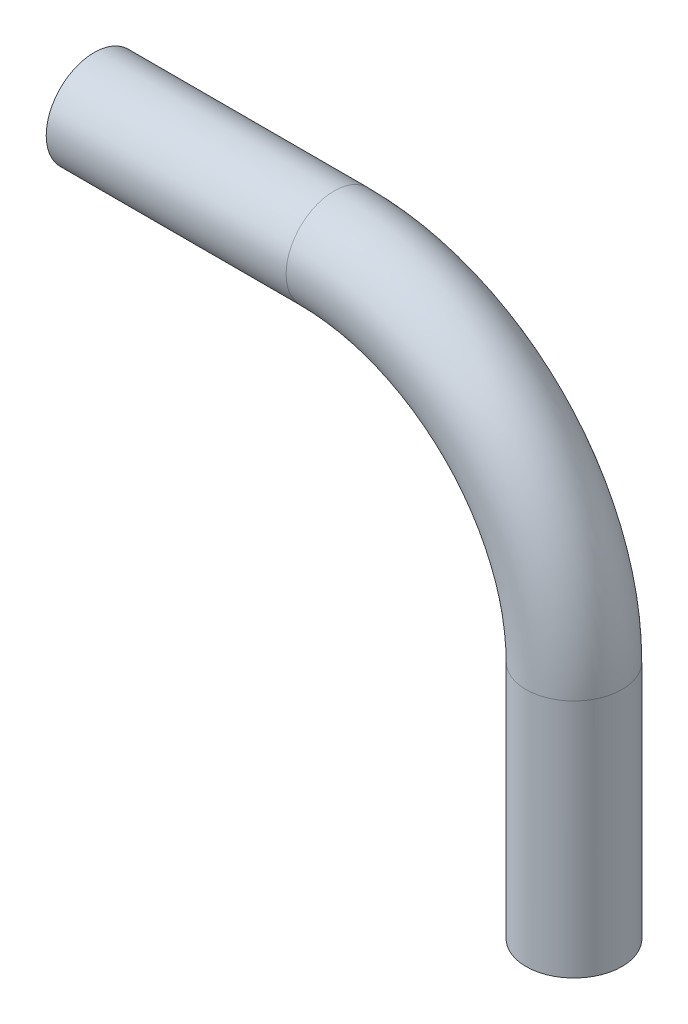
ISO-10303-21;
HEADER;
FILE_DESCRIPTION(('STEP AP214'),'2;1');
FILE_NAME('part.step','',(''),(''),'','','');
FILE_SCHEMA(('AUTOMOTIVE_DESIGN { 1 0 10303 214 1 1 1 1 }'));
ENDSEC;
DATA;
#1=APPLICATION_CONTEXT('core data for automotive mechanical design processes');
#2=APPLICATION_PROTOCOL_DEFINITION('international standard','automotive_design',2000,#1);
#3=PRODUCT_CONTEXT('',#1,'mechanical');
#4=PRODUCT('Part','Part','',(#3));
#5=PRODUCT_RELATED_PRODUCT_CATEGORY('part','',(#4));
#6=PRODUCT_DEFINITION_FORMATION('','',#4);
#7=PRODUCT_DEFINITION_CONTEXT('part definition',#1,'design');
#8=PRODUCT_DEFINITION('design','',#6,#7);
#9=PRODUCT_DEFINITION_SHAPE('','',#8);
#10=(LENGTH_UNIT() NAMED_UNIT(*) SI_UNIT(.MILLI.,.METRE.));
#11=(NAMED_UNIT(*) PLANE_ANGLE_UNIT() SI_UNIT($,.RADIAN.));
#12=(NAMED_UNIT(*) SI_UNIT($,.STERADIAN.) SOLID_ANGLE_UNIT());
#13=UNCERTAINTY_MEASURE_WITH_UNIT(LENGTH_MEASURE(1.E-05),#10,'distance_accuracy_value','');
#14=(GEOMETRIC_REPRESENTATION_CONTEXT(3) GLOBAL_UNCERTAINTY_ASSIGNED_CONTEXT((#13)) GLOBAL_UNIT_ASSIGNED_CONTEXT((#10,
#11,#12)) REPRESENTATION_CONTEXT('',''));
#15=CARTESIAN_POINT('',(0.,0.,0.));
#16=DIRECTION('',(0.,0.,1.));
#17=DIRECTION('',(1.,0.,0.));
#18=AXIS2_PLACEMENT_3D('',#15,#16,#17);
#19=CARTESIAN_POINT('',(-23.8125,47.625,0.));
#20=DIRECTION('',(-1.,0.,0.));
#21=DIRECTION('',(0.,0.,1.));
#22=AXIS2_PLACEMENT_3D('',#19,#20,#21);
#23=CYLINDRICAL_SURFACE('',#22,4.7625);
#24=CARTESIAN_POINT('',(-23.8125,47.625,0.));
#25=DIRECTION('',(-1.,0.,0.));
#26=DIRECTION('',(0.,0.,1.));
#27=AXIS2_PLACEMENT_3D('',#24,#25,#26);
#28=CIRCLE('',#27,4.7625);
#29=CARTESIAN_POINT('',(-23.8125,52.3875,0.));
#30=VERTEX_POINT('',#29);
#31=EDGE_CURVE('E49',#30,#30,#28,.T.);
#32=ORIENTED_EDGE('',*,*,#31,.T.);
#33=EDGE_LOOP('',(#32));
#34=FACE_BOUND('',#33,.T.);
#35=CARTESIAN_POINT('',(-47.625,47.625,0.));
#36=DIRECTION('',(-1.,0.,0.));
#37=DIRECTION('',(0.,0.,1.));
#38=AXIS2_PLACEMENT_3D('',#35,#36,#37);
#39=CIRCLE('',#38,4.7625);
#40=CARTESIAN_POINT('',(-47.625,47.625,4.7625));
#41=VERTEX_POINT('',#40);
#42=EDGE_CURVE('E10',#41,#41,#39,.T.);
#43=ORIENTED_EDGE('',*,*,#42,.F.);
#44=EDGE_LOOP('',(#43));
#45=FACE_BOUND('',#44,.T.);
#46=ADVANCED_FACE('F36',(#34,#45),#23,.T.);
#47=CARTESIAN_POINT('',(-23.8125,47.625,0.));
#48=DIRECTION('',(-1.,0.,0.));
#49=DIRECTION('',(0.,0.,1.));
#50=AXIS2_PLACEMENT_3D('',#47,#48,#49);
#51=CYLINDRICAL_SURFACE('',#50,3.8735);
#52=CARTESIAN_POINT('',(-23.8125,47.625,0.));
#53=DIRECTION('',(-1.,0.,0.));
#54=DIRECTION('',(0.,0.,1.));
#55=AXIS2_PLACEMENT_3D('',#52,#53,#54);
#56=CIRCLE('',#55,3.8735);
#57=CARTESIAN_POINT('',(-23.8125,51.4985,0.));
#58=VERTEX_POINT('',#57);
#59=EDGE_CURVE('E54',#58,#58,#56,.T.);
#60=ORIENTED_EDGE('',*,*,#59,.F.);
#61=EDGE_LOOP('',(#60));
#62=FACE_BOUND('',#61,.T.);
#63=CARTESIAN_POINT('',(-47.625,47.625,0.));
#64=DIRECTION('',(-1.,0.,0.));
#65=DIRECTION('',(0.,0.,1.));
#66=AXIS2_PLACEMENT_3D('',#63,#64,#65);
#67=CIRCLE('',#66,3.8735);
#68=CARTESIAN_POINT('',(-47.625,47.625,3.8735));
#69=VERTEX_POINT('',#68);
#70=EDGE_CURVE('E43',#69,#69,#67,.T.);
#71=ORIENTED_EDGE('',*,*,#70,.T.);
#72=EDGE_LOOP('',(#71));
#73=FACE_BOUND('',#72,.T.);
#74=ADVANCED_FACE('F86',(#62,#73),#51,.F.);
#75=CARTESIAN_POINT('',(-23.8125,23.8125,0.));
#76=DIRECTION('',(0.,0.,1.));
#77=DIRECTION('',(1.,0.,0.));
#78=AXIS2_PLACEMENT_3D('',#75,#76,#77);
#79=TOROIDAL_SURFACE('',#78,23.8125,4.7625);
#80=CARTESIAN_POINT('',(0.,23.8125,0.));
#81=DIRECTION('',(0.,1.,0.));
#82=DIRECTION('',(0.,0.,1.));
#83=AXIS2_PLACEMENT_3D('',#80,#81,#82);
#84=CIRCLE('',#83,4.7625);
#85=CARTESIAN_POINT('',(4.7625,23.8125,0.));
#86=VERTEX_POINT('',#85);
#87=EDGE_CURVE('E60',#86,#86,#84,.T.);
#88=CARTESIAN_POINT('',(-23.8125,23.8125,0.));
#89=DIRECTION('',(0.,0.,1.));
#90=DIRECTION('',(1.,0.,0.));
#91=AXIS2_PLACEMENT_3D('',#88,#89,#90);
#92=CIRCLE('',#91,28.575);
#93=EDGE_CURVE('',#86,#30,#92,.T.);
#94=ORIENTED_EDGE('',*,*,#87,.T.);
#95=ORIENTED_EDGE('',*,*,#31,.F.);
#96=ORIENTED_EDGE('',*,*,#93,.T.);
#97=ORIENTED_EDGE('',*,*,#93,.F.);
#98=EDGE_LOOP('',(#94,#96,#95,#97));
#99=FACE_BOUND('',#98,.T.);
#100=ADVANCED_FACE('F82',(#99),#79,.T.);
#101=CARTESIAN_POINT('',(-23.8125,23.8125,0.));
#102=DIRECTION('',(0.,0.,1.));
#103=DIRECTION('',(1.,0.,0.));
#104=AXIS2_PLACEMENT_3D('',#101,#102,#103);
#105=TOROIDAL_SURFACE('',#104,23.8125,3.8735);
#106=CARTESIAN_POINT('',(0.,23.8125,0.));
#107=DIRECTION('',(0.,1.,0.));
#108=DIRECTION('',(0.,0.,1.));
#109=AXIS2_PLACEMENT_3D('',#106,#107,#108);
#110=CIRCLE('',#109,3.8735);
#111=CARTESIAN_POINT('',(3.8735,23.8125,0.));
#112=VERTEX_POINT('',#111);
#113=EDGE_CURVE('E65',#112,#112,#110,.T.);
#114=CARTESIAN_POINT('',(-23.8125,23.8125,0.));
#115=DIRECTION('',(0.,0.,1.));
#116=DIRECTION('',(1.,0.,0.));
#117=AXIS2_PLACEMENT_3D('',#114,#115,#116);
#118=CIRCLE('',#117,27.686);
#119=EDGE_CURVE('',#112,#58,#118,.T.);
#120=ORIENTED_EDGE('',*,*,#113,.F.);
#121=ORIENTED_EDGE('',*,*,#59,.T.);
#122=ORIENTED_EDGE('',*,*,#119,.T.);
#123=ORIENTED_EDGE('',*,*,#119,.F.);
#124=EDGE_LOOP('',(#120,#122,#121,#123));
#125=FACE_BOUND('',#124,.T.);
#126=ADVANCED_FACE('F79',(#125),#105,.F.);
#127=CARTESIAN_POINT('',(0.,23.8125,0.));
#128=DIRECTION('',(0.,-1.,0.));
#129=DIRECTION('',(1.,0.,0.));
#130=AXIS2_PLACEMENT_3D('',#127,#128,#129);
#131=CYLINDRICAL_SURFACE('',#130,3.8735);
#132=ORIENTED_EDGE('',*,*,#113,.T.);
#133=EDGE_LOOP('',(#132));
#134=FACE_BOUND('',#133,.T.);
#135=CARTESIAN_POINT('',(0.,0.,0.));
#136=DIRECTION('',(0.,1.,0.));
#137=DIRECTION('',(0.,0.,1.));
#138=AXIS2_PLACEMENT_3D('',#135,#136,#137);
#139=CIRCLE('',#138,3.8735);
#140=CARTESIAN_POINT('',(0.,0.,3.8735));
#141=VERTEX_POINT('',#140);
#142=EDGE_CURVE('E66',#141,#141,#139,.T.);
#143=ORIENTED_EDGE('',*,*,#142,.F.);
#144=EDGE_LOOP('',(#143));
#145=FACE_BOUND('',#144,.T.);
#146=ADVANCED_FACE('F76',(#134,#145),#131,.F.);
#147=CARTESIAN_POINT('',(0.,23.8125,0.));
#148=DIRECTION('',(0.,-1.,0.));
#149=DIRECTION('',(1.,0.,0.));
#150=AXIS2_PLACEMENT_3D('',#147,#148,#149);
#151=CYLINDRICAL_SURFACE('',#150,4.7625);
#152=ORIENTED_EDGE('',*,*,#87,.F.);
#153=EDGE_LOOP('',(#152));
#154=FACE_BOUND('',#153,.T.);
#155=CARTESIAN_POINT('',(0.,0.,0.));
#156=DIRECTION('',(0.,1.,0.));
#157=DIRECTION('',(0.,0.,1.));
#158=AXIS2_PLACEMENT_3D('',#155,#156,#157);
#159=CIRCLE('',#158,4.7625);
#160=CARTESIAN_POINT('',(0.,0.,4.7625));
#161=VERTEX_POINT('',#160);
#162=EDGE_CURVE('E61',#161,#161,#159,.T.);
#163=ORIENTED_EDGE('',*,*,#162,.T.);
#164=EDGE_LOOP('',(#163));
#165=FACE_BOUND('',#164,.T.);
#166=ADVANCED_FACE('F98',(#154,#165),#151,.T.);
#167=CARTESIAN_POINT('',(-47.625,47.625,0.));
#168=DIRECTION('',(-1.,0.,0.));
#169=DIRECTION('',(0.,0.,1.));
#170=AXIS2_PLACEMENT_3D('',#167,#168,#169);
#171=PLANE('',#170);
#172=ORIENTED_EDGE('',*,*,#70,.F.);
#173=EDGE_LOOP('',(#172));
#174=FACE_BOUND('',#173,.T.);
#175=ORIENTED_EDGE('',*,*,#42,.T.);
#176=EDGE_LOOP('',(#175));
#177=FACE_BOUND('',#176,.T.);
#178=ADVANCED_FACE('F101',(#174,#177),#171,.T.);
#179=CARTESIAN_POINT('',(0.,0.,0.));
#180=DIRECTION('',(0.,1.,0.));
#181=DIRECTION('',(0.,0.,1.));
#182=AXIS2_PLACEMENT_3D('',#179,#180,#181);
#183=PLANE('',#182);
#184=ORIENTED_EDGE('',*,*,#142,.T.);
#185=EDGE_LOOP('',(#184));
#186=FACE_BOUND('',#185,.T.);
#187=ORIENTED_EDGE('',*,*,#162,.F.);
#188=EDGE_LOOP('',(#187));
#189=FACE_BOUND('',#188,.T.);
#190=ADVANCED_FACE('F103',(#186,#189),#183,.F.);
#191=CLOSED_SHELL('',(#46,#74,#100,#126,#146,#166,#178,#190));
#192=MANIFOLD_SOLID_BREP('B2',#191);
#193=ADVANCED_BREP_SHAPE_REPRESENTATION('',(#18,#192),#14);
#194=SHAPE_DEFINITION_REPRESENTATION(#9,#193);
ENDSEC;
END-ISO-10303-21;
